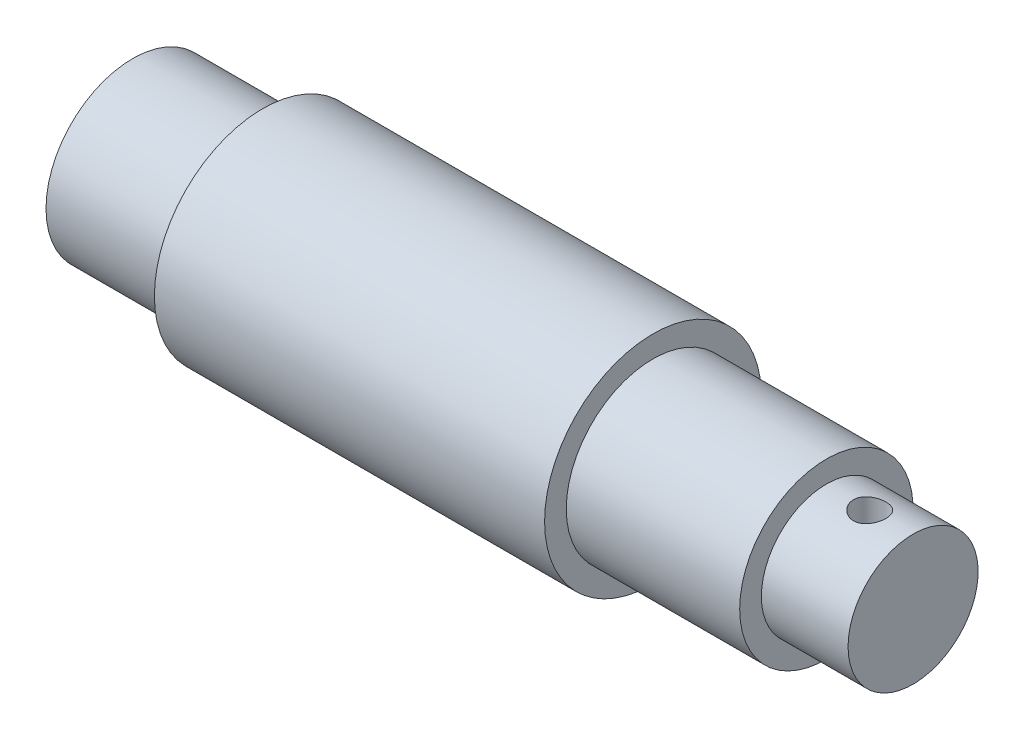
from build123d import *

# Parameters (mm, degrees)
CUT_EXTRUDE1_DEPTH      = 59.241997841
CUT_EXTRUDE1_DEPTH_BACK = 59.241997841
SKETCH2_R               = 1.190625


with BuildPart() as part:
    # Sketch1 → Revolve1 (revolve)
    with BuildSketch(Plane.XY, mode=Mode.PRIVATE) as revolve1_sk:
        Polygon((0, 0), (0, 6.35), (9.525, 6.35), (9.525, 7.9375), (38.1, 7.9375), (38.1, 6.35), (50.8, 6.35), (50.8, 4.7625), (57.15, 4.7625), (57.15, 0), align=None)
    revolve(revolve1_sk.sketch.rotate(Axis((0, 0, 0), (1, 0, 0)), 90), axis=Axis((0, 0, 0), (1, 0, 0)))

    # Sketch2 → Cut-Extrude1 (cut, two sides: drawn at the far end of the back side and taken through both)
    with BuildSketch(Plane(origin=(0, 0, 0), x_dir=(1, 0, 0), z_dir=(0, 1, 0)).offset(-CUT_EXTRUDE1_DEPTH_BACK)):
        with Locations(Location((53.975, 0, 0), (0, 0, 270))):
            Circle(SKETCH2_R)
    extrude(amount=CUT_EXTRUDE1_DEPTH + CUT_EXTRUDE1_DEPTH_BACK, mode=Mode.SUBTRACT)


solid = part.part
